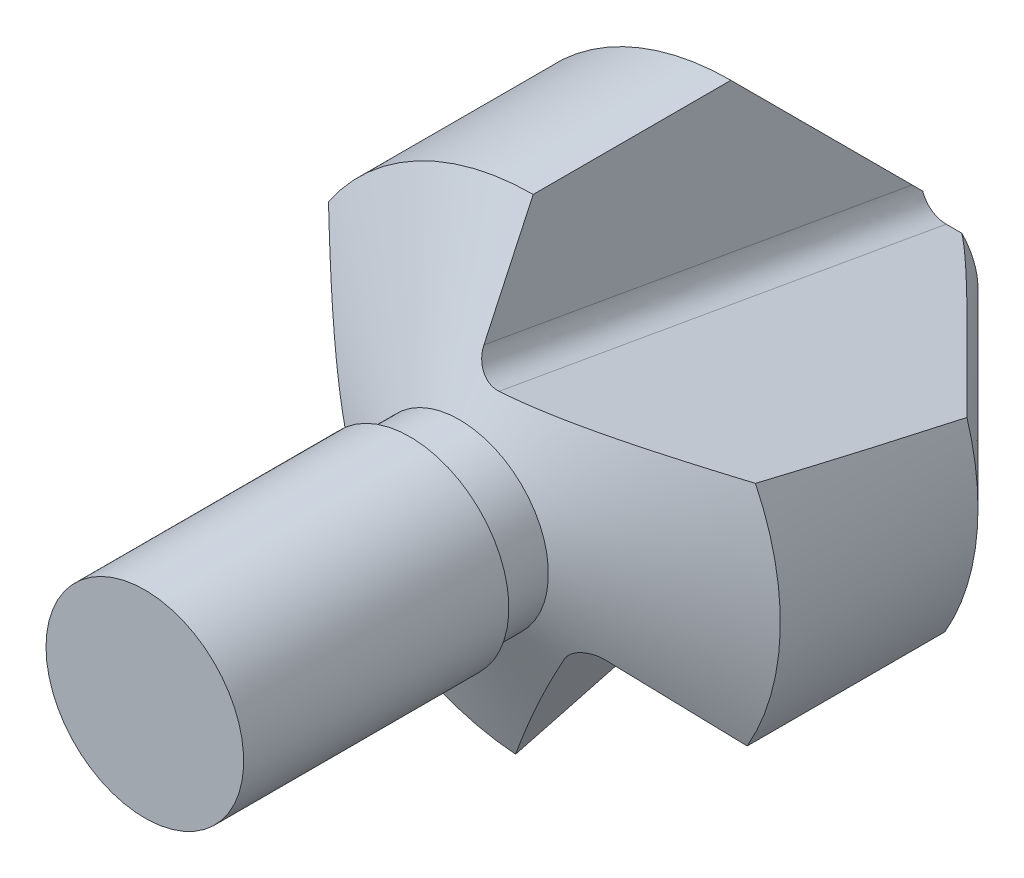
from build123d import *

# Parameters (mm, degrees)
REPDENT_COUNT = 3


with BuildPart() as part:
    # EsqCorps → CorpsOutil (revolve)
    with BuildSketch(Plane(origin=(0, 0, 0), x_dir=(0, 0, -1), z_dir=(1, 0, 0)), mode=Mode.PRIVATE) as corpsoutil_sk:
        Polygon((7.1e-08, 0.114285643), (7.1e-08, 0), (-1.5714285, 0), (-1.5714285, 0.2), (-1.034932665, 0.2), (-1.034932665, 0.18), (-0.934932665, 0.18), (-0.785714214, 0.5), (-0.385714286, 0.5), align=None)
    revolve(corpsoutil_sk.sketch.rotate(Axis((0, 0, -0.140668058), (0, 0, 1)), 90), axis=Axis((0, 0, -0.140668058), (0, 0, 1)))

    # Dent: sweep along a curve in space
    with BuildLine() as dent_path:
        Line((0, 0, 0), (0, 0.487033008, 2.762101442))
    # EsqDent → Dent (sweep, cut)
    with BuildSketch(Plane(origin=(0, 0, 0), x_dir=(-1, 0, 0), z_dir=(0, 0, -1))):
        with BuildLine():
            Line((0, 0.13), (0, 2.4))
            ThreePointArc((0, 2.4), (-1.668532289, 1.725108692), (-2.398666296, 0.08))
            Line((-2.398666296, 0.08), (-0.05, 0.08))
            ThreePointArc((-0.05, 0.08), (-0.014644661, 0.094644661), (0, 0.13))
        make_face()
    dent = sweep(path=dent_path.line, mode=Mode.SUBTRACT)

    # RepDent: Dent ×3 about axis
    repdent_axis = Axis((0, 0, 3.296905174), (0, 0, -1))
    for i in range(1, REPDENT_COUNT):
        add(dent.rotate(repdent_axis, i * 360 / REPDENT_COUNT), mode=Mode.SUBTRACT)


solid = part.part
